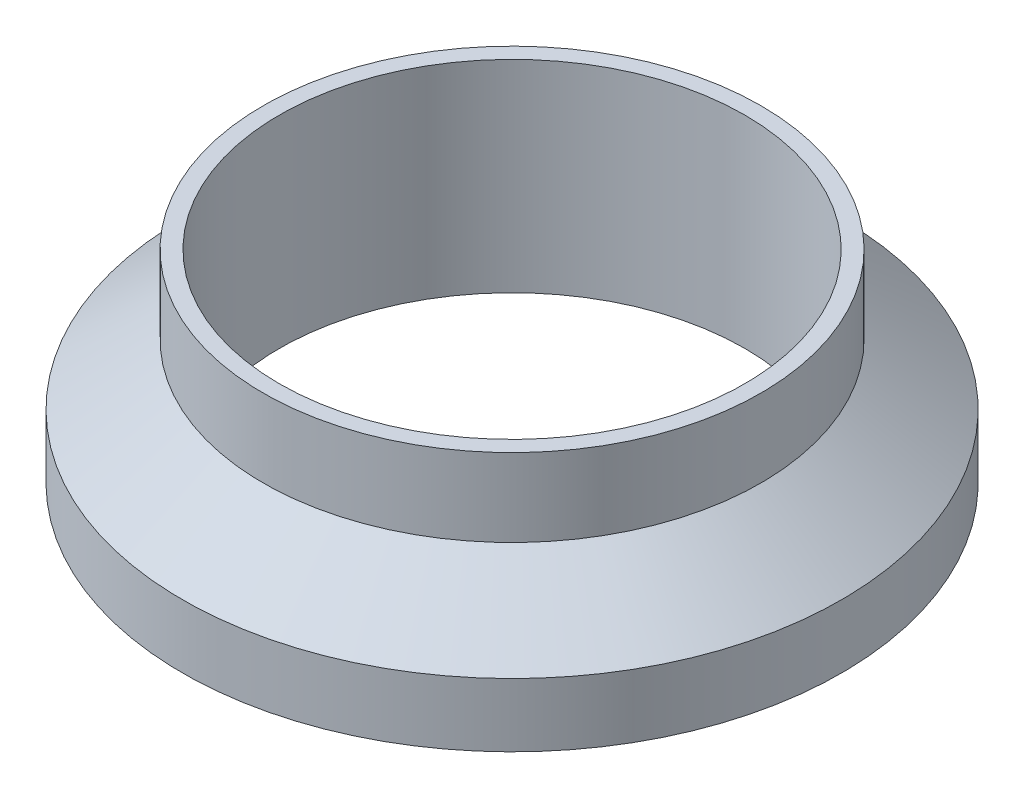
ISO-10303-21;
HEADER;
FILE_DESCRIPTION(('STEP AP214'),'2;1');
FILE_NAME('part.step','',(''),(''),'','','');
FILE_SCHEMA(('AUTOMOTIVE_DESIGN { 1 0 10303 214 1 1 1 1 }'));
ENDSEC;
DATA;
#1=APPLICATION_CONTEXT('core data for automotive mechanical design processes');
#2=APPLICATION_PROTOCOL_DEFINITION('international standard','automotive_design',2000,#1);
#3=PRODUCT_CONTEXT('',#1,'mechanical');
#4=PRODUCT('Part','Part','',(#3));
#5=PRODUCT_RELATED_PRODUCT_CATEGORY('part','',(#4));
#6=PRODUCT_DEFINITION_FORMATION('','',#4);
#7=PRODUCT_DEFINITION_CONTEXT('part definition',#1,'design');
#8=PRODUCT_DEFINITION('design','',#6,#7);
#9=PRODUCT_DEFINITION_SHAPE('','',#8);
#10=(LENGTH_UNIT() NAMED_UNIT(*) SI_UNIT(.MILLI.,.METRE.));
#11=(NAMED_UNIT(*) PLANE_ANGLE_UNIT() SI_UNIT($,.RADIAN.));
#12=(NAMED_UNIT(*) SI_UNIT($,.STERADIAN.) SOLID_ANGLE_UNIT());
#13=UNCERTAINTY_MEASURE_WITH_UNIT(LENGTH_MEASURE(1.E-05),#10,'distance_accuracy_value','');
#14=(GEOMETRIC_REPRESENTATION_CONTEXT(3) GLOBAL_UNCERTAINTY_ASSIGNED_CONTEXT((#13)) GLOBAL_UNIT_ASSIGNED_CONTEXT((#10,
#11,#12)) REPRESENTATION_CONTEXT('',''));
#15=CARTESIAN_POINT('',(0.,0.,0.));
#16=DIRECTION('',(0.,0.,1.));
#17=DIRECTION('',(1.,0.,0.));
#18=AXIS2_PLACEMENT_3D('',#15,#16,#17);
#19=CARTESIAN_POINT('',(-23.749,0.,0.));
#20=DIRECTION('',(0.,1.,0.));
#21=DIRECTION('',(0.,0.,1.));
#22=AXIS2_PLACEMENT_3D('',#19,#20,#21);
#23=PLANE('',#22);
#24=CARTESIAN_POINT('',(0.,0.,0.));
#25=DIRECTION('',(0.,-1.,0.));
#26=DIRECTION('',(0.,0.,-1.));
#27=AXIS2_PLACEMENT_3D('',#24,#25,#26);
#28=CIRCLE('',#27,23.749);
#29=CARTESIAN_POINT('',(0.,0.,-23.749));
#30=VERTEX_POINT('',#29);
#31=EDGE_CURVE('E10',#30,#30,#28,.T.);
#32=ORIENTED_EDGE('',*,*,#31,.F.);
#33=EDGE_LOOP('',(#32));
#34=FACE_BOUND('',#33,.T.);
#35=CARTESIAN_POINT('',(0.,0.,0.));
#36=DIRECTION('',(0.,-1.,0.));
#37=DIRECTION('',(0.,0.,-1.));
#38=AXIS2_PLACEMENT_3D('',#35,#36,#37);
#39=CIRCLE('',#38,27.1739836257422);
#40=CARTESIAN_POINT('',(0.,0.,-27.1739836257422));
#41=VERTEX_POINT('',#40);
#42=EDGE_CURVE('E59',#41,#41,#39,.T.);
#43=ORIENTED_EDGE('',*,*,#42,.T.);
#44=EDGE_LOOP('',(#43));
#45=FACE_BOUND('',#44,.T.);
#46=ADVANCED_FACE('F31',(#34,#45),#23,.F.);
#47=CARTESIAN_POINT('',(0.,0.,0.));
#48=DIRECTION('',(0.,-1.,0.));
#49=DIRECTION('',(0.,0.,-1.));
#50=AXIS2_PLACEMENT_3D('',#47,#48,#49);
#51=CYLINDRICAL_SURFACE('',#50,23.749);
#52=CARTESIAN_POINT('',(0.,20.6248,0.));
#53=DIRECTION('',(0.,-1.,0.));
#54=DIRECTION('',(0.,0.,-1.));
#55=AXIS2_PLACEMENT_3D('',#52,#53,#54);
#56=CIRCLE('',#55,23.749);
#57=CARTESIAN_POINT('',(0.,20.6248,-23.749));
#58=VERTEX_POINT('',#57);
#59=EDGE_CURVE('E37',#58,#58,#56,.T.);
#60=ORIENTED_EDGE('',*,*,#59,.F.);
#61=EDGE_LOOP('',(#60));
#62=FACE_BOUND('',#61,.T.);
#63=ORIENTED_EDGE('',*,*,#31,.T.);
#64=EDGE_LOOP('',(#63));
#65=FACE_BOUND('',#64,.T.);
#66=ADVANCED_FACE('F96',(#62,#65),#51,.F.);
#67=CARTESIAN_POINT('',(-23.749,20.6248,0.));
#68=DIRECTION('',(0.,-1.,0.));
#69=DIRECTION('',(0.,0.,-1.));
#70=AXIS2_PLACEMENT_3D('',#67,#68,#69);
#71=PLANE('',#70);
#72=CARTESIAN_POINT('',(0.,20.6248,0.));
#73=DIRECTION('',(0.,-1.,0.));
#74=DIRECTION('',(0.,0.,-1.));
#75=AXIS2_PLACEMENT_3D('',#72,#73,#74);
#76=CIRCLE('',#75,25.4);
#77=CARTESIAN_POINT('',(0.,20.6248,-25.4));
#78=VERTEX_POINT('',#77);
#79=EDGE_CURVE('E41',#78,#78,#76,.T.);
#80=ORIENTED_EDGE('',*,*,#79,.F.);
#81=EDGE_LOOP('',(#80));
#82=FACE_BOUND('',#81,.T.);
#83=ORIENTED_EDGE('',*,*,#59,.T.);
#84=EDGE_LOOP('',(#83));
#85=FACE_BOUND('',#84,.T.);
#86=ADVANCED_FACE('F91',(#82,#85),#71,.F.);
#87=CARTESIAN_POINT('',(0.,0.,0.));
#88=DIRECTION('',(0.,-1.,0.));
#89=DIRECTION('',(0.,0.,-1.));
#90=AXIS2_PLACEMENT_3D('',#87,#88,#89);
#91=CYLINDRICAL_SURFACE('',#90,25.4);
#92=CARTESIAN_POINT('',(0.,12.6784484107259,0.));
#93=DIRECTION('',(0.,-1.,0.));
#94=DIRECTION('',(0.,0.,-1.));
#95=AXIS2_PLACEMENT_3D('',#92,#93,#94);
#96=CIRCLE('',#95,25.4);
#97=CARTESIAN_POINT('',(0.,12.6784484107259,-25.4));
#98=VERTEX_POINT('',#97);
#99=EDGE_CURVE('E45',#98,#98,#96,.T.);
#100=ORIENTED_EDGE('',*,*,#99,.F.);
#101=EDGE_LOOP('',(#100));
#102=FACE_BOUND('',#101,.T.);
#103=ORIENTED_EDGE('',*,*,#79,.T.);
#104=EDGE_LOOP('',(#103));
#105=FACE_BOUND('',#104,.T.);
#106=ADVANCED_FACE('F85',(#102,#105),#91,.T.);
#107=CARTESIAN_POINT('',(0.,12.6784484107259,0.));
#108=DIRECTION('',(0.,-1.,0.));
#109=DIRECTION('',(0.,0.,-1.));
#110=AXIS2_PLACEMENT_3D('',#107,#108,#109);
#111=CONICAL_SURFACE('',#110,25.4,0.925024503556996);
#112=CARTESIAN_POINT('',(0.,6.477,0.));
#113=DIRECTION('',(0.,-1.,0.));
#114=DIRECTION('',(0.,0.,-1.));
#115=AXIS2_PLACEMENT_3D('',#112,#113,#114);
#116=CIRCLE('',#115,33.6296);
#117=CARTESIAN_POINT('',(0.,6.477,-33.6296));
#118=VERTEX_POINT('',#117);
#119=EDGE_CURVE('E50',#118,#118,#116,.T.);
#120=ORIENTED_EDGE('',*,*,#119,.F.);
#121=EDGE_LOOP('',(#120));
#122=FACE_BOUND('',#121,.T.);
#123=ORIENTED_EDGE('',*,*,#99,.T.);
#124=EDGE_LOOP('',(#123));
#125=FACE_BOUND('',#124,.T.);
#126=ADVANCED_FACE('F79',(#122,#125),#111,.T.);
#127=CARTESIAN_POINT('',(0.,0.,0.));
#128=DIRECTION('',(0.,-1.,0.));
#129=DIRECTION('',(0.,0.,-1.));
#130=AXIS2_PLACEMENT_3D('',#127,#128,#129);
#131=CYLINDRICAL_SURFACE('',#130,33.6296);
#132=CARTESIAN_POINT('',(0.,0.,0.));
#133=DIRECTION('',(0.,-1.,0.));
#134=DIRECTION('',(0.,0.,-1.));
#135=AXIS2_PLACEMENT_3D('',#132,#133,#134);
#136=CIRCLE('',#135,33.6296);
#137=CARTESIAN_POINT('',(0.,0.,-33.6296));
#138=VERTEX_POINT('',#137);
#139=EDGE_CURVE('E53',#138,#138,#136,.T.);
#140=ORIENTED_EDGE('',*,*,#139,.F.);
#141=EDGE_LOOP('',(#140));
#142=FACE_BOUND('',#141,.T.);
#143=ORIENTED_EDGE('',*,*,#119,.T.);
#144=EDGE_LOOP('',(#143));
#145=FACE_BOUND('',#144,.T.);
#146=ADVANCED_FACE('F73',(#142,#145),#131,.T.);
#147=CARTESIAN_POINT('',(-33.6296,0.,0.));
#148=DIRECTION('',(0.,1.,0.));
#149=DIRECTION('',(0.,0.,1.));
#150=AXIS2_PLACEMENT_3D('',#147,#148,#149);
#151=PLANE('',#150);
#152=CARTESIAN_POINT('',(0.,0.,0.));
#153=DIRECTION('',(0.,-1.,0.));
#154=DIRECTION('',(0.,0.,-1.));
#155=AXIS2_PLACEMENT_3D('',#152,#153,#154);
#156=CIRCLE('',#155,30.2300163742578);
#157=CARTESIAN_POINT('',(0.,0.,-30.2300163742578));
#158=VERTEX_POINT('',#157);
#159=EDGE_CURVE('E56',#158,#158,#156,.T.);
#160=ORIENTED_EDGE('',*,*,#159,.F.);
#161=EDGE_LOOP('',(#160));
#162=FACE_BOUND('',#161,.T.);
#163=ORIENTED_EDGE('',*,*,#139,.T.);
#164=EDGE_LOOP('',(#163));
#165=FACE_BOUND('',#164,.T.);
#166=ADVANCED_FACE('F67',(#162,#165),#151,.F.);
#167=CARTESIAN_POINT('',(0.,-0.381,0.));
#168=DIRECTION('',(0.,-1.,0.));
#169=DIRECTION('',(0.,0.,-1.));
#170=AXIS2_PLACEMENT_3D('',#167,#168,#169);
#171=TOROIDAL_SURFACE('',#170,28.702,1.5748);
#172=ORIENTED_EDGE('',*,*,#42,.F.);
#173=EDGE_LOOP('',(#172));
#174=FACE_BOUND('',#173,.T.);
#175=ORIENTED_EDGE('',*,*,#159,.T.);
#176=EDGE_LOOP('',(#175));
#177=FACE_BOUND('',#176,.T.);
#178=ADVANCED_FACE('F64',(#174,#177),#171,.F.);
#179=CLOSED_SHELL('',(#46,#66,#86,#106,#126,#146,#166,#178));
#180=MANIFOLD_SOLID_BREP('B2',#179);
#181=ADVANCED_BREP_SHAPE_REPRESENTATION('',(#18,#180),#14);
#182=SHAPE_DEFINITION_REPRESENTATION(#9,#181);
ENDSEC;
END-ISO-10303-21;
